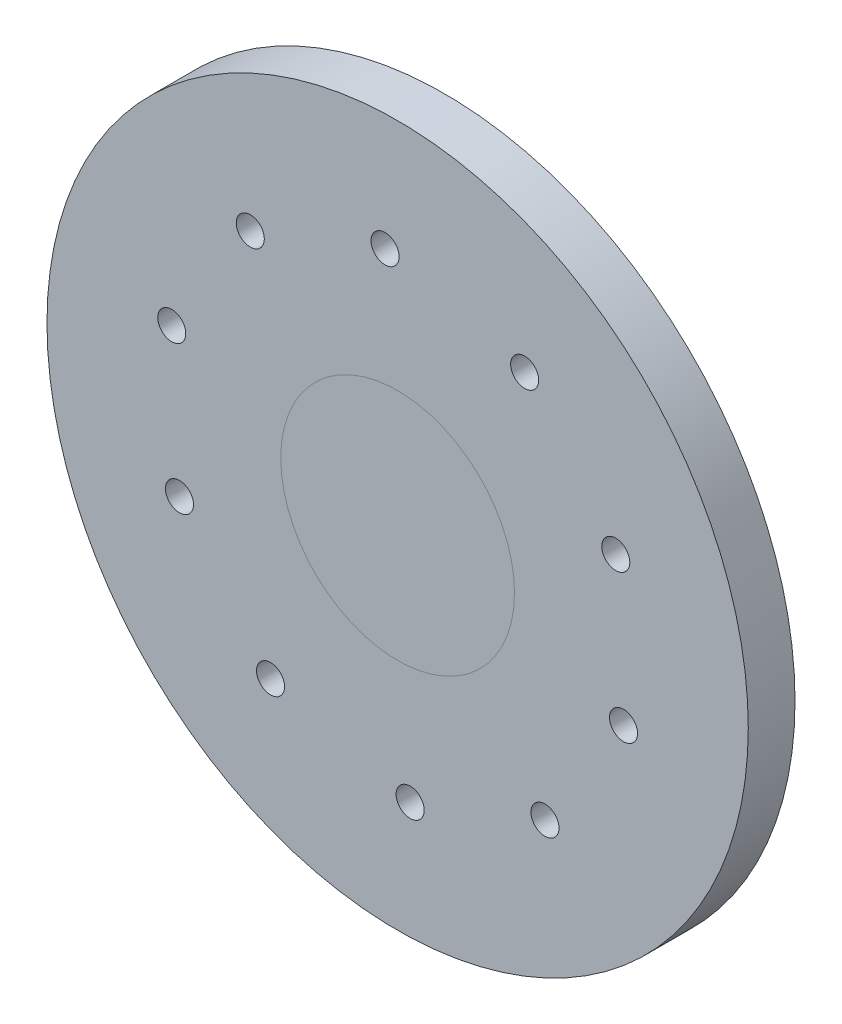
ISO-10303-21;
HEADER;
FILE_DESCRIPTION(('STEP AP214'),'2;1');
FILE_NAME('part.step','',(''),(''),'','','');
FILE_SCHEMA(('AUTOMOTIVE_DESIGN { 1 0 10303 214 1 1 1 1 }'));
ENDSEC;
DATA;
#1=APPLICATION_CONTEXT('core data for automotive mechanical design processes');
#2=APPLICATION_PROTOCOL_DEFINITION('international standard','automotive_design',2000,#1);
#3=PRODUCT_CONTEXT('',#1,'mechanical');
#4=PRODUCT('Part','Part','',(#3));
#5=PRODUCT_RELATED_PRODUCT_CATEGORY('part','',(#4));
#6=PRODUCT_DEFINITION_FORMATION('','',#4);
#7=PRODUCT_DEFINITION_CONTEXT('part definition',#1,'design');
#8=PRODUCT_DEFINITION('design','',#6,#7);
#9=PRODUCT_DEFINITION_SHAPE('','',#8);
#10=(LENGTH_UNIT() NAMED_UNIT(*) SI_UNIT(.MILLI.,.METRE.));
#11=(NAMED_UNIT(*) PLANE_ANGLE_UNIT() SI_UNIT($,.RADIAN.));
#12=(NAMED_UNIT(*) SI_UNIT($,.STERADIAN.) SOLID_ANGLE_UNIT());
#13=UNCERTAINTY_MEASURE_WITH_UNIT(LENGTH_MEASURE(1.E-05),#10,'distance_accuracy_value','');
#14=(GEOMETRIC_REPRESENTATION_CONTEXT(3) GLOBAL_UNCERTAINTY_ASSIGNED_CONTEXT((#13)) GLOBAL_UNIT_ASSIGNED_CONTEXT((#10,
#11,#12)) REPRESENTATION_CONTEXT('',''));
#15=CARTESIAN_POINT('',(0.,0.,0.));
#16=DIRECTION('',(0.,0.,1.));
#17=DIRECTION('',(1.,0.,0.));
#18=AXIS2_PLACEMENT_3D('',#15,#16,#17);
#19=CARTESIAN_POINT('',(0.,0.,20.));
#20=DIRECTION('',(0.,0.,1.));
#21=DIRECTION('',(1.,0.,0.));
#22=AXIS2_PLACEMENT_3D('',#19,#20,#21);
#23=PLANE('',#22);
#24=CARTESIAN_POINT('',(0.,0.,20.));
#25=DIRECTION('',(0.,0.,1.));
#26=DIRECTION('',(1.,0.,0.));
#27=AXIS2_PLACEMENT_3D('',#24,#25,#26);
#28=CIRCLE('',#27,150.);
#29=CARTESIAN_POINT('',(150.,0.,20.));
#30=VERTEX_POINT('',#29);
#31=EDGE_CURVE('E54',#30,#30,#28,.T.);
#32=ORIENTED_EDGE('',*,*,#31,.T.);
#33=EDGE_LOOP('',(#32));
#34=FACE_BOUND('',#33,.T.);
#35=CARTESIAN_POINT('',(-54.3533877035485,-83.938723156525,20.));
#36=DIRECTION('',(0.,0.,-1.));
#37=DIRECTION('',(-1.,0.,0.));
#38=AXIS2_PLACEMENT_3D('',#35,#36,#37);
#39=CIRCLE('',#38,5.99999999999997);
#40=CARTESIAN_POINT('',(-60.3533877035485,-83.938723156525,20.));
#41=VERTEX_POINT('',#40);
#42=EDGE_CURVE('E65',#41,#41,#39,.T.);
#43=ORIENTED_EDGE('',*,*,#42,.T.);
#44=EDGE_LOOP('',(#43));
#45=FACE_BOUND('',#44,.T.);
#46=CARTESIAN_POINT('',(-93.3107579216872,-35.9597338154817,20.));
#47=DIRECTION('',(0.,0.,-1.));
#48=DIRECTION('',(-1.,0.,0.));
#49=AXIS2_PLACEMENT_3D('',#46,#47,#48);
#50=CIRCLE('',#49,5.99999999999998);
#51=CARTESIAN_POINT('',(-99.3107579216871,-35.9597338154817,20.));
#52=VERTEX_POINT('',#51);
#53=EDGE_CURVE('E74',#52,#52,#50,.T.);
#54=ORIENTED_EDGE('',*,*,#53,.T.);
#55=EDGE_LOOP('',(#54));
#56=FACE_BOUND('',#55,.T.);
#57=CARTESIAN_POINT('',(-96.6265901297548,25.7546516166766,20.));
#58=DIRECTION('',(0.,0.,-1.));
#59=DIRECTION('',(-1.,0.,0.));
#60=AXIS2_PLACEMENT_3D('',#57,#58,#59);
#61=CIRCLE('',#60,5.99999999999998);
#62=CARTESIAN_POINT('',(-102.626590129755,25.7546516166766,20.));
#63=VERTEX_POINT('',#62);
#64=EDGE_CURVE('E143',#63,#63,#61,.T.);
#65=ORIENTED_EDGE('',*,*,#64,.T.);
#66=EDGE_LOOP('',(#65));
#67=FACE_BOUND('',#66,.T.);
#68=CARTESIAN_POINT('',(-63.0343491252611,77.631635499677,20.));
#69=DIRECTION('',(0.,0.,-1.));
#70=DIRECTION('',(-1.,0.,0.));
#71=AXIS2_PLACEMENT_3D('',#68,#69,#70);
#72=CIRCLE('',#71,5.99999999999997);
#73=CARTESIAN_POINT('',(-69.0343491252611,77.631635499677,20.));
#74=VERTEX_POINT('',#73);
#75=EDGE_CURVE('E135',#74,#74,#72,.T.);
#76=ORIENTED_EDGE('',*,*,#75,.T.);
#77=EDGE_LOOP('',(#76));
#78=FACE_BOUND('',#77,.T.);
#79=CARTESIAN_POINT('',(-5.36512921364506,99.8559732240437,20.));
#80=DIRECTION('',(0.,0.,-1.));
#81=DIRECTION('',(-1.,0.,0.));
#82=AXIS2_PLACEMENT_3D('',#79,#80,#81);
#83=CIRCLE('',#82,5.99999999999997);
#84=CARTESIAN_POINT('',(-11.365129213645,99.8559732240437,20.));
#85=VERTEX_POINT('',#84);
#86=EDGE_CURVE('E127',#85,#85,#83,.T.);
#87=ORIENTED_EDGE('',*,*,#86,.T.);
#88=EDGE_LOOP('',(#87));
#89=FACE_BOUND('',#88,.T.);
#90=CARTESIAN_POINT('',(54.3533877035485,83.9387231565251,20.));
#91=DIRECTION('',(0.,0.,-1.));
#92=DIRECTION('',(-1.,0.,0.));
#93=AXIS2_PLACEMENT_3D('',#90,#91,#92);
#94=CIRCLE('',#93,5.99999999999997);
#95=CARTESIAN_POINT('',(48.3533877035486,83.9387231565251,20.));
#96=VERTEX_POINT('',#95);
#97=EDGE_CURVE('E120',#96,#96,#94,.T.);
#98=ORIENTED_EDGE('',*,*,#97,.T.);
#99=EDGE_LOOP('',(#98));
#100=FACE_BOUND('',#99,.T.);
#101=CARTESIAN_POINT('',(93.3107579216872,35.9597338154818,20.));
#102=DIRECTION('',(0.,0.,-1.));
#103=DIRECTION('',(-1.,0.,0.));
#104=AXIS2_PLACEMENT_3D('',#101,#102,#103);
#105=CIRCLE('',#104,5.99999999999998);
#106=CARTESIAN_POINT('',(87.3107579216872,35.9597338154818,20.));
#107=VERTEX_POINT('',#106);
#108=EDGE_CURVE('E113',#107,#107,#105,.T.);
#109=ORIENTED_EDGE('',*,*,#108,.T.);
#110=EDGE_LOOP('',(#109));
#111=FACE_BOUND('',#110,.T.);
#112=CARTESIAN_POINT('',(96.6265901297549,-25.7546516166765,20.));
#113=DIRECTION('',(0.,0.,-1.));
#114=DIRECTION('',(-1.,0.,0.));
#115=AXIS2_PLACEMENT_3D('',#112,#113,#114);
#116=CIRCLE('',#115,5.99999999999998);
#117=CARTESIAN_POINT('',(90.6265901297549,-25.7546516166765,20.));
#118=VERTEX_POINT('',#117);
#119=EDGE_CURVE('E104',#118,#118,#116,.T.);
#120=ORIENTED_EDGE('',*,*,#119,.T.);
#121=EDGE_LOOP('',(#120));
#122=FACE_BOUND('',#121,.T.);
#123=CARTESIAN_POINT('',(63.0343491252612,-77.6316354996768,20.));
#124=DIRECTION('',(0.,0.,-1.));
#125=DIRECTION('',(-1.,0.,0.));
#126=AXIS2_PLACEMENT_3D('',#123,#124,#125);
#127=CIRCLE('',#126,5.99999999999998);
#128=CARTESIAN_POINT('',(57.0343491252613,-77.6316354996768,20.));
#129=VERTEX_POINT('',#128);
#130=EDGE_CURVE('E96',#129,#129,#127,.T.);
#131=ORIENTED_EDGE('',*,*,#130,.T.);
#132=EDGE_LOOP('',(#131));
#133=FACE_BOUND('',#132,.T.);
#134=CARTESIAN_POINT('',(5.36512921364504,-99.8559732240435,20.));
#135=DIRECTION('',(0.,0.,-1.));
#136=DIRECTION('',(-1.,0.,0.));
#137=AXIS2_PLACEMENT_3D('',#134,#135,#136);
#138=CIRCLE('',#137,5.99999999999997);
#139=CARTESIAN_POINT('',(-0.634870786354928,-99.8559732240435,20.));
#140=VERTEX_POINT('',#139);
#141=EDGE_CURVE('E89',#140,#140,#138,.T.);
#142=ORIENTED_EDGE('',*,*,#141,.T.);
#143=EDGE_LOOP('',(#142));
#144=FACE_BOUND('',#143,.T.);
#145=CARTESIAN_POINT('',(0.,0.,20.));
#146=DIRECTION('',(0.,0.,1.));
#147=DIRECTION('',(1.,0.,0.));
#148=AXIS2_PLACEMENT_3D('',#145,#146,#147);
#149=CIRCLE('',#148,50.);
#150=CARTESIAN_POINT('',(50.,0.,20.));
#151=VERTEX_POINT('',#150);
#152=EDGE_CURVE('E11',#151,#151,#149,.F.);
#153=ORIENTED_EDGE('',*,*,#152,.T.);
#154=EDGE_LOOP('',(#153));
#155=FACE_BOUND('',#154,.T.);
#156=ADVANCED_FACE('F46',(#34,#45,#56,#67,#78,#89,#100,#111,#122,#133,#144,#155),#23,.T.);
#157=CARTESIAN_POINT('',(0.,0.,20.));
#158=DIRECTION('',(0.,0.,-1.));
#159=DIRECTION('',(-1.,0.,0.));
#160=AXIS2_PLACEMENT_3D('',#157,#158,#159);
#161=CYLINDRICAL_SURFACE('',#160,150.);
#162=ORIENTED_EDGE('',*,*,#31,.F.);
#163=EDGE_LOOP('',(#162));
#164=FACE_BOUND('',#163,.T.);
#165=CARTESIAN_POINT('',(0.,0.,0.));
#166=DIRECTION('',(0.,0.,1.));
#167=DIRECTION('',(1.,0.,0.));
#168=AXIS2_PLACEMENT_3D('',#165,#166,#167);
#169=CIRCLE('',#168,150.);
#170=CARTESIAN_POINT('',(150.,0.,0.));
#171=VERTEX_POINT('',#170);
#172=EDGE_CURVE('E60',#171,#171,#169,.T.);
#173=ORIENTED_EDGE('',*,*,#172,.T.);
#174=EDGE_LOOP('',(#173));
#175=FACE_BOUND('',#174,.T.);
#176=ADVANCED_FACE('F48',(#164,#175),#161,.T.);
#177=ORIENTED_EDGE('',*,*,#152,.F.);
#178=EDGE_LOOP('',(#177));
#179=FACE_BOUND('',#178,.T.);
#180=ADVANCED_FACE('F173',(#179),#23,.T.);
#181=CARTESIAN_POINT('',(0.,0.,0.));
#182=DIRECTION('',(0.,0.,1.));
#183=DIRECTION('',(1.,0.,0.));
#184=AXIS2_PLACEMENT_3D('',#181,#182,#183);
#185=PLANE('',#184);
#186=CARTESIAN_POINT('',(5.36512921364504,-99.8559732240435,0.));
#187=DIRECTION('',(0.,0.,-1.));
#188=DIRECTION('',(-1.,0.,0.));
#189=AXIS2_PLACEMENT_3D('',#186,#187,#188);
#190=CIRCLE('',#189,5.99999999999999);
#191=CARTESIAN_POINT('',(-0.634870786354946,-99.8559732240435,0.));
#192=VERTEX_POINT('',#191);
#193=EDGE_CURVE('E84',#192,#192,#190,.T.);
#194=ORIENTED_EDGE('',*,*,#193,.F.);
#195=EDGE_LOOP('',(#194));
#196=FACE_BOUND('',#195,.T.);
#197=CARTESIAN_POINT('',(63.0343491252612,-77.6316354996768,0.));
#198=DIRECTION('',(0.,0.,-1.));
#199=DIRECTION('',(-1.,0.,0.));
#200=AXIS2_PLACEMENT_3D('',#197,#198,#199);
#201=CIRCLE('',#200,5.99999999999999);
#202=CARTESIAN_POINT('',(57.0343491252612,-77.6316354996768,0.));
#203=VERTEX_POINT('',#202);
#204=EDGE_CURVE('E91',#203,#203,#201,.T.);
#205=ORIENTED_EDGE('',*,*,#204,.F.);
#206=EDGE_LOOP('',(#205));
#207=FACE_BOUND('',#206,.T.);
#208=CARTESIAN_POINT('',(96.6265901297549,-25.7546516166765,0.));
#209=DIRECTION('',(0.,0.,-1.));
#210=DIRECTION('',(-1.,0.,0.));
#211=AXIS2_PLACEMENT_3D('',#208,#209,#210);
#212=CIRCLE('',#211,5.99999999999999);
#213=CARTESIAN_POINT('',(90.6265901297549,-25.7546516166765,0.));
#214=VERTEX_POINT('',#213);
#215=EDGE_CURVE('E99',#214,#214,#212,.T.);
#216=ORIENTED_EDGE('',*,*,#215,.F.);
#217=EDGE_LOOP('',(#216));
#218=FACE_BOUND('',#217,.T.);
#219=CARTESIAN_POINT('',(93.3107579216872,35.9597338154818,0.));
#220=DIRECTION('',(0.,0.,-1.));
#221=DIRECTION('',(-1.,0.,0.));
#222=AXIS2_PLACEMENT_3D('',#219,#220,#221);
#223=CIRCLE('',#222,5.99999999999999);
#224=CARTESIAN_POINT('',(87.3107579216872,35.9597338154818,0.));
#225=VERTEX_POINT('',#224);
#226=EDGE_CURVE('E108',#225,#225,#223,.T.);
#227=ORIENTED_EDGE('',*,*,#226,.F.);
#228=EDGE_LOOP('',(#227));
#229=FACE_BOUND('',#228,.T.);
#230=CARTESIAN_POINT('',(54.3533877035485,83.9387231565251,0.));
#231=DIRECTION('',(0.,0.,-1.));
#232=DIRECTION('',(-1.,0.,0.));
#233=AXIS2_PLACEMENT_3D('',#230,#231,#232);
#234=CIRCLE('',#233,5.99999999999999);
#235=CARTESIAN_POINT('',(48.3533877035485,83.9387231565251,0.));
#236=VERTEX_POINT('',#235);
#237=EDGE_CURVE('E115',#236,#236,#234,.T.);
#238=ORIENTED_EDGE('',*,*,#237,.F.);
#239=EDGE_LOOP('',(#238));
#240=FACE_BOUND('',#239,.T.);
#241=CARTESIAN_POINT('',(-5.36512921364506,99.8559732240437,0.));
#242=DIRECTION('',(0.,0.,-1.));
#243=DIRECTION('',(-1.,0.,0.));
#244=AXIS2_PLACEMENT_3D('',#241,#242,#243);
#245=CIRCLE('',#244,5.99999999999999);
#246=CARTESIAN_POINT('',(-11.3651292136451,99.8559732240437,0.));
#247=VERTEX_POINT('',#246);
#248=EDGE_CURVE('E122',#247,#247,#245,.T.);
#249=ORIENTED_EDGE('',*,*,#248,.F.);
#250=EDGE_LOOP('',(#249));
#251=FACE_BOUND('',#250,.T.);
#252=CARTESIAN_POINT('',(-63.0343491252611,77.631635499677,0.));
#253=DIRECTION('',(0.,0.,-1.));
#254=DIRECTION('',(-1.,0.,0.));
#255=AXIS2_PLACEMENT_3D('',#252,#253,#254);
#256=CIRCLE('',#255,5.99999999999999);
#257=CARTESIAN_POINT('',(-69.0343491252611,77.631635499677,0.));
#258=VERTEX_POINT('',#257);
#259=EDGE_CURVE('E130',#258,#258,#256,.T.);
#260=ORIENTED_EDGE('',*,*,#259,.F.);
#261=EDGE_LOOP('',(#260));
#262=FACE_BOUND('',#261,.T.);
#263=CARTESIAN_POINT('',(-96.6265901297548,25.7546516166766,0.));
#264=DIRECTION('',(0.,0.,-1.));
#265=DIRECTION('',(-1.,0.,0.));
#266=AXIS2_PLACEMENT_3D('',#263,#264,#265);
#267=CIRCLE('',#266,5.99999999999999);
#268=CARTESIAN_POINT('',(-102.626590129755,25.7546516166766,0.));
#269=VERTEX_POINT('',#268);
#270=EDGE_CURVE('E138',#269,#269,#267,.T.);
#271=ORIENTED_EDGE('',*,*,#270,.F.);
#272=EDGE_LOOP('',(#271));
#273=FACE_BOUND('',#272,.T.);
#274=CARTESIAN_POINT('',(-93.3107579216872,-35.9597338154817,0.));
#275=DIRECTION('',(0.,0.,-1.));
#276=DIRECTION('',(-1.,0.,0.));
#277=AXIS2_PLACEMENT_3D('',#274,#275,#276);
#278=CIRCLE('',#277,5.99999999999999);
#279=CARTESIAN_POINT('',(-99.3107579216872,-35.9597338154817,0.));
#280=VERTEX_POINT('',#279);
#281=EDGE_CURVE('E145',#280,#280,#278,.T.);
#282=ORIENTED_EDGE('',*,*,#281,.F.);
#283=EDGE_LOOP('',(#282));
#284=FACE_BOUND('',#283,.T.);
#285=CARTESIAN_POINT('',(-54.3533877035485,-83.938723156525,0.));
#286=DIRECTION('',(0.,0.,-1.));
#287=DIRECTION('',(-1.,0.,0.));
#288=AXIS2_PLACEMENT_3D('',#285,#286,#287);
#289=CIRCLE('',#288,5.99999999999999);
#290=CARTESIAN_POINT('',(-60.3533877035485,-83.938723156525,0.));
#291=VERTEX_POINT('',#290);
#292=EDGE_CURVE('E69',#291,#291,#289,.T.);
#293=ORIENTED_EDGE('',*,*,#292,.F.);
#294=EDGE_LOOP('',(#293));
#295=FACE_BOUND('',#294,.T.);
#296=ORIENTED_EDGE('',*,*,#172,.F.);
#297=EDGE_LOOP('',(#296));
#298=FACE_BOUND('',#297,.T.);
#299=ADVANCED_FACE('F168',(#196,#207,#218,#229,#240,#251,#262,#273,#284,#295,#298),#185,.F.);
#300=CARTESIAN_POINT('',(-54.3533877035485,-83.938723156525,0.));
#301=DIRECTION('',(0.,0.,-1.));
#302=DIRECTION('',(-1.,0.,0.));
#303=AXIS2_PLACEMENT_3D('',#300,#301,#302);
#304=CYLINDRICAL_SURFACE('',#303,5.99999999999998);
#305=ORIENTED_EDGE('',*,*,#42,.F.);
#306=EDGE_LOOP('',(#305));
#307=FACE_BOUND('',#306,.T.);
#308=ORIENTED_EDGE('',*,*,#292,.T.);
#309=EDGE_LOOP('',(#308));
#310=FACE_BOUND('',#309,.T.);
#311=ADVANCED_FACE('F159',(#307,#310),#304,.F.);
#312=CARTESIAN_POINT('',(-93.3107579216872,-35.9597338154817,0.));
#313=DIRECTION('',(0.,0.,-1.));
#314=DIRECTION('',(-1.,0.,0.));
#315=AXIS2_PLACEMENT_3D('',#312,#313,#314);
#316=CYLINDRICAL_SURFACE('',#315,5.99999999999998);
#317=ORIENTED_EDGE('',*,*,#53,.F.);
#318=EDGE_LOOP('',(#317));
#319=FACE_BOUND('',#318,.T.);
#320=ORIENTED_EDGE('',*,*,#281,.T.);
#321=EDGE_LOOP('',(#320));
#322=FACE_BOUND('',#321,.T.);
#323=ADVANCED_FACE('F156',(#319,#322),#316,.F.);
#324=CARTESIAN_POINT('',(-96.6265901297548,25.7546516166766,0.));
#325=DIRECTION('',(0.,0.,-1.));
#326=DIRECTION('',(-1.,0.,0.));
#327=AXIS2_PLACEMENT_3D('',#324,#325,#326);
#328=CYLINDRICAL_SURFACE('',#327,5.99999999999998);
#329=ORIENTED_EDGE('',*,*,#64,.F.);
#330=EDGE_LOOP('',(#329));
#331=FACE_BOUND('',#330,.T.);
#332=ORIENTED_EDGE('',*,*,#270,.T.);
#333=EDGE_LOOP('',(#332));
#334=FACE_BOUND('',#333,.T.);
#335=ADVANCED_FACE('F158',(#331,#334),#328,.F.);
#336=CARTESIAN_POINT('',(-63.0343491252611,77.631635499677,0.));
#337=DIRECTION('',(0.,0.,-1.));
#338=DIRECTION('',(-1.,0.,0.));
#339=AXIS2_PLACEMENT_3D('',#336,#337,#338);
#340=CYLINDRICAL_SURFACE('',#339,5.99999999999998);
#341=ORIENTED_EDGE('',*,*,#75,.F.);
#342=EDGE_LOOP('',(#341));
#343=FACE_BOUND('',#342,.T.);
#344=ORIENTED_EDGE('',*,*,#259,.T.);
#345=EDGE_LOOP('',(#344));
#346=FACE_BOUND('',#345,.T.);
#347=ADVANCED_FACE('F165',(#343,#346),#340,.F.);
#348=CARTESIAN_POINT('',(-5.36512921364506,99.8559732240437,0.));
#349=DIRECTION('',(0.,0.,-1.));
#350=DIRECTION('',(-1.,0.,0.));
#351=AXIS2_PLACEMENT_3D('',#348,#349,#350);
#352=CYLINDRICAL_SURFACE('',#351,5.99999999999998);
#353=ORIENTED_EDGE('',*,*,#86,.F.);
#354=EDGE_LOOP('',(#353));
#355=FACE_BOUND('',#354,.T.);
#356=ORIENTED_EDGE('',*,*,#248,.T.);
#357=EDGE_LOOP('',(#356));
#358=FACE_BOUND('',#357,.T.);
#359=ADVANCED_FACE('F210',(#355,#358),#352,.F.);
#360=CARTESIAN_POINT('',(54.3533877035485,83.9387231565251,0.));
#361=DIRECTION('',(0.,0.,-1.));
#362=DIRECTION('',(-1.,0.,0.));
#363=AXIS2_PLACEMENT_3D('',#360,#361,#362);
#364=CYLINDRICAL_SURFACE('',#363,5.99999999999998);
#365=ORIENTED_EDGE('',*,*,#97,.F.);
#366=EDGE_LOOP('',(#365));
#367=FACE_BOUND('',#366,.T.);
#368=ORIENTED_EDGE('',*,*,#237,.T.);
#369=EDGE_LOOP('',(#368));
#370=FACE_BOUND('',#369,.T.);
#371=ADVANCED_FACE('F216',(#367,#370),#364,.F.);
#372=CARTESIAN_POINT('',(93.3107579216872,35.9597338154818,0.));
#373=DIRECTION('',(0.,0.,-1.));
#374=DIRECTION('',(-1.,0.,0.));
#375=AXIS2_PLACEMENT_3D('',#372,#373,#374);
#376=CYLINDRICAL_SURFACE('',#375,5.99999999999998);
#377=ORIENTED_EDGE('',*,*,#108,.F.);
#378=EDGE_LOOP('',(#377));
#379=FACE_BOUND('',#378,.T.);
#380=ORIENTED_EDGE('',*,*,#226,.T.);
#381=EDGE_LOOP('',(#380));
#382=FACE_BOUND('',#381,.T.);
#383=ADVANCED_FACE('F223',(#379,#382),#376,.F.);
#384=CARTESIAN_POINT('',(96.6265901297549,-25.7546516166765,0.));
#385=DIRECTION('',(0.,0.,-1.));
#386=DIRECTION('',(-1.,0.,0.));
#387=AXIS2_PLACEMENT_3D('',#384,#385,#386);
#388=CYLINDRICAL_SURFACE('',#387,5.99999999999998);
#389=ORIENTED_EDGE('',*,*,#119,.F.);
#390=EDGE_LOOP('',(#389));
#391=FACE_BOUND('',#390,.T.);
#392=ORIENTED_EDGE('',*,*,#215,.T.);
#393=EDGE_LOOP('',(#392));
#394=FACE_BOUND('',#393,.T.);
#395=ADVANCED_FACE('F227',(#391,#394),#388,.F.);
#396=CARTESIAN_POINT('',(63.0343491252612,-77.6316354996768,0.));
#397=DIRECTION('',(0.,0.,-1.));
#398=DIRECTION('',(-1.,0.,0.));
#399=AXIS2_PLACEMENT_3D('',#396,#397,#398);
#400=CYLINDRICAL_SURFACE('',#399,5.99999999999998);
#401=ORIENTED_EDGE('',*,*,#130,.F.);
#402=EDGE_LOOP('',(#401));
#403=FACE_BOUND('',#402,.T.);
#404=ORIENTED_EDGE('',*,*,#204,.T.);
#405=EDGE_LOOP('',(#404));
#406=FACE_BOUND('',#405,.T.);
#407=ADVANCED_FACE('F231',(#403,#406),#400,.F.);
#408=CARTESIAN_POINT('',(5.36512921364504,-99.8559732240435,0.));
#409=DIRECTION('',(0.,0.,-1.));
#410=DIRECTION('',(-1.,0.,0.));
#411=AXIS2_PLACEMENT_3D('',#408,#409,#410);
#412=CYLINDRICAL_SURFACE('',#411,5.99999999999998);
#413=ORIENTED_EDGE('',*,*,#141,.F.);
#414=EDGE_LOOP('',(#413));
#415=FACE_BOUND('',#414,.T.);
#416=ORIENTED_EDGE('',*,*,#193,.T.);
#417=EDGE_LOOP('',(#416));
#418=FACE_BOUND('',#417,.T.);
#419=ADVANCED_FACE('F235',(#415,#418),#412,.F.);
#420=CLOSED_SHELL('',(#156,#176,#180,#299,#311,#323,#335,#347,#359,#371,#383,#395,#407,#419));
#421=MANIFOLD_SOLID_BREP('B2',#420);
#422=ADVANCED_BREP_SHAPE_REPRESENTATION('',(#18,#421),#14);
#423=SHAPE_DEFINITION_REPRESENTATION(#9,#422);
ENDSEC;
END-ISO-10303-21;
